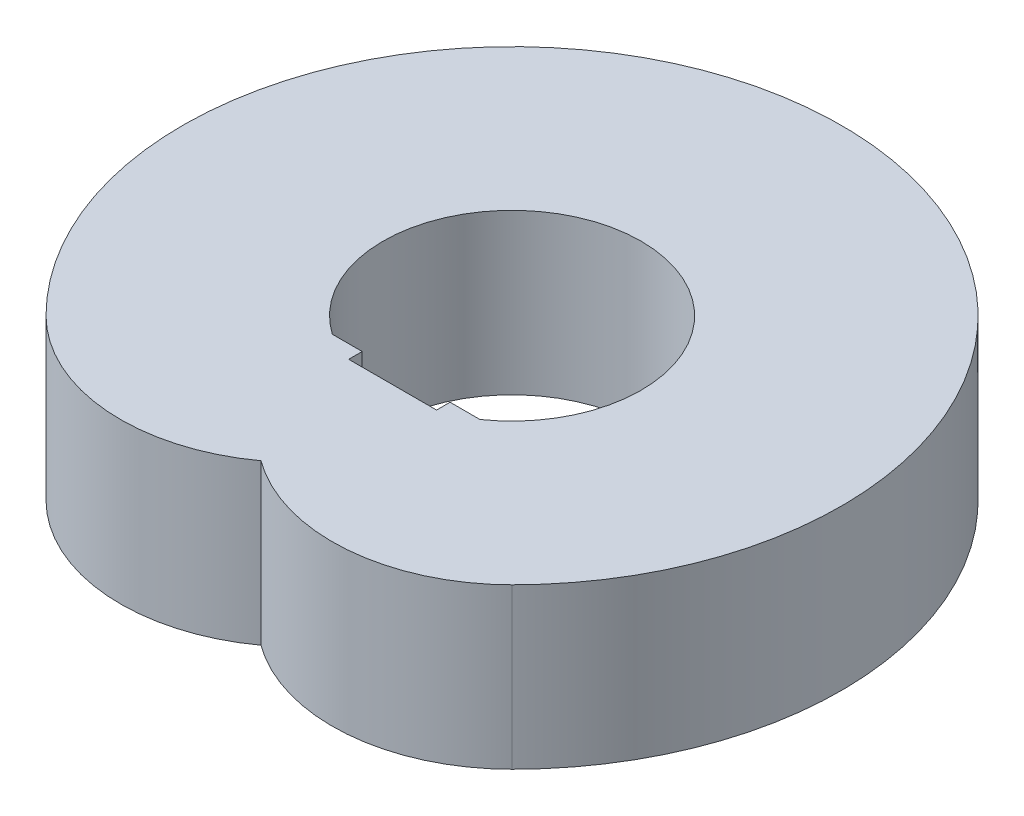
from build123d import *

# Parameters (mm, degrees)
EXTRUDE_1_DEPTH = 400


with BuildPart() as part:
    # Sketch 1 → Extrude 1 (new body)
    with BuildSketch(Plane(origin=(0, 0, 0), x_dir=(1, 0, 0), z_dir=(0, 1, 0))):
        with BuildLine():
            ThreePointArc((583.363094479, -583.363094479), (0, 825), (-583.363094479, -583.363094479))
            ThreePointArc((-583.363094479, -583.363094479), (-300.063671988, -713.809763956), (0, -628.741032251))
            ThreePointArc((0, -628.741032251), (300.063671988, -713.809763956), (583.363094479, -583.363094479))
        make_face()
        with BuildLine():
            Line((-110, -265.165042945), (-110, -299))
            Line((-110, -299), (110, -299))
            Line((110, -299), (110, -265.165042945))
            Line((110, -265.165042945), (184.834957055, -265.165042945))
            ThreePointArc((184.834957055, -265.165042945), (0, 323.22818774), (-184.834957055, -265.165042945))
            Line((-184.834957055, -265.165042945), (-110, -265.165042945))
        make_face(mode=Mode.SUBTRACT)
    extrude(amount=EXTRUDE_1_DEPTH)


solid = part.part
